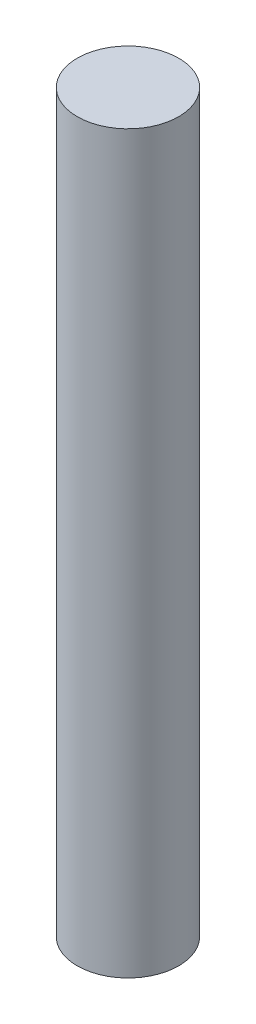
ISO-10303-21;
HEADER;
FILE_DESCRIPTION(('STEP AP214'),'2;1');
FILE_NAME('part.step','',(''),(''),'','','');
FILE_SCHEMA(('AUTOMOTIVE_DESIGN { 1 0 10303 214 1 1 1 1 }'));
ENDSEC;
DATA;
#1=APPLICATION_CONTEXT('core data for automotive mechanical design processes');
#2=APPLICATION_PROTOCOL_DEFINITION('international standard','automotive_design',2000,#1);
#3=PRODUCT_CONTEXT('',#1,'mechanical');
#4=PRODUCT('Part','Part','',(#3));
#5=PRODUCT_RELATED_PRODUCT_CATEGORY('part','',(#4));
#6=PRODUCT_DEFINITION_FORMATION('','',#4);
#7=PRODUCT_DEFINITION_CONTEXT('part definition',#1,'design');
#8=PRODUCT_DEFINITION('design','',#6,#7);
#9=PRODUCT_DEFINITION_SHAPE('','',#8);
#10=(LENGTH_UNIT() NAMED_UNIT(*) SI_UNIT(.MILLI.,.METRE.));
#11=(NAMED_UNIT(*) PLANE_ANGLE_UNIT() SI_UNIT($,.RADIAN.));
#12=(NAMED_UNIT(*) SI_UNIT($,.STERADIAN.) SOLID_ANGLE_UNIT());
#13=UNCERTAINTY_MEASURE_WITH_UNIT(LENGTH_MEASURE(1.E-05),#10,'distance_accuracy_value','');
#14=(GEOMETRIC_REPRESENTATION_CONTEXT(3) GLOBAL_UNCERTAINTY_ASSIGNED_CONTEXT((#13)) GLOBAL_UNIT_ASSIGNED_CONTEXT((#10,
#11,#12)) REPRESENTATION_CONTEXT('',''));
#15=CARTESIAN_POINT('',(0.,0.,0.));
#16=DIRECTION('',(0.,0.,1.));
#17=DIRECTION('',(1.,0.,0.));
#18=AXIS2_PLACEMENT_3D('',#15,#16,#17);
#19=CARTESIAN_POINT('',(0.,18.415,0.));
#20=DIRECTION('',(0.,-1.,0.));
#21=DIRECTION('',(0.,0.,-1.));
#22=AXIS2_PLACEMENT_3D('',#19,#20,#21);
#23=CYLINDRICAL_SURFACE('',#22,2.54);
#24=CARTESIAN_POINT('',(0.,18.415,0.));
#25=DIRECTION('',(0.,1.,0.));
#26=DIRECTION('',(0.,0.,1.));
#27=AXIS2_PLACEMENT_3D('',#24,#25,#26);
#28=CIRCLE('',#27,2.54);
#29=CARTESIAN_POINT('',(0.,18.415,2.54));
#30=VERTEX_POINT('',#29);
#31=EDGE_CURVE('E12',#30,#30,#28,.T.);
#32=ORIENTED_EDGE('',*,*,#31,.F.);
#33=EDGE_LOOP('',(#32));
#34=FACE_BOUND('',#33,.T.);
#35=CARTESIAN_POINT('',(0.,-18.415,0.));
#36=DIRECTION('',(0.,1.,0.));
#37=DIRECTION('',(0.,0.,1.));
#38=AXIS2_PLACEMENT_3D('',#35,#36,#37);
#39=CIRCLE('',#38,2.54);
#40=CARTESIAN_POINT('',(0.,-18.415,2.54));
#41=VERTEX_POINT('',#40);
#42=EDGE_CURVE('E46',#41,#41,#39,.T.);
#43=ORIENTED_EDGE('',*,*,#42,.T.);
#44=EDGE_LOOP('',(#43));
#45=FACE_BOUND('',#44,.T.);
#46=ADVANCED_FACE('F40',(#34,#45),#23,.T.);
#47=CARTESIAN_POINT('',(0.,18.415,0.));
#48=DIRECTION('',(0.,1.,0.));
#49=DIRECTION('',(0.,0.,1.));
#50=AXIS2_PLACEMENT_3D('',#47,#48,#49);
#51=PLANE('',#50);
#52=ORIENTED_EDGE('',*,*,#31,.T.);
#53=EDGE_LOOP('',(#52));
#54=FACE_BOUND('',#53,.T.);
#55=ADVANCED_FACE('F55',(#54),#51,.T.);
#56=CARTESIAN_POINT('',(0.,-18.415,0.));
#57=DIRECTION('',(0.,1.,0.));
#58=DIRECTION('',(0.,0.,1.));
#59=AXIS2_PLACEMENT_3D('',#56,#57,#58);
#60=PLANE('',#59);
#61=ORIENTED_EDGE('',*,*,#42,.F.);
#62=EDGE_LOOP('',(#61));
#63=FACE_BOUND('',#62,.T.);
#64=ADVANCED_FACE('F53',(#63),#60,.F.);
#65=CLOSED_SHELL('',(#46,#55,#64));
#66=MANIFOLD_SOLID_BREP('B2',#65);
#67=ADVANCED_BREP_SHAPE_REPRESENTATION('',(#18,#66),#14);
#68=SHAPE_DEFINITION_REPRESENTATION(#9,#67);
ENDSEC;
END-ISO-10303-21;
